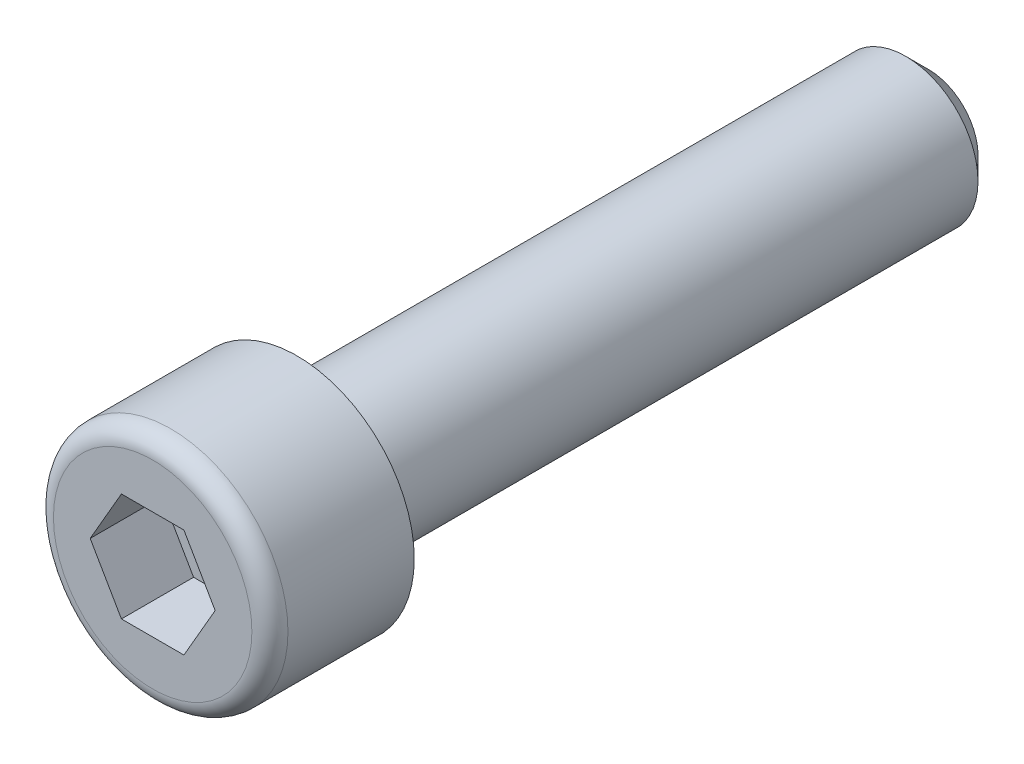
ISO-10303-21;
HEADER;
FILE_DESCRIPTION(('STEP AP214'),'2;1');
FILE_NAME('part.step','',(''),(''),'','','');
FILE_SCHEMA(('AUTOMOTIVE_DESIGN { 1 0 10303 214 1 1 1 1 }'));
ENDSEC;
DATA;
#1=APPLICATION_CONTEXT('core data for automotive mechanical design processes');
#2=APPLICATION_PROTOCOL_DEFINITION('international standard','automotive_design',2000,#1);
#3=PRODUCT_CONTEXT('',#1,'mechanical');
#4=PRODUCT('Part','Part','',(#3));
#5=PRODUCT_RELATED_PRODUCT_CATEGORY('part','',(#4));
#6=PRODUCT_DEFINITION_FORMATION('','',#4);
#7=PRODUCT_DEFINITION_CONTEXT('part definition',#1,'design');
#8=PRODUCT_DEFINITION('design','',#6,#7);
#9=PRODUCT_DEFINITION_SHAPE('','',#8);
#10=(LENGTH_UNIT() NAMED_UNIT(*) SI_UNIT(.MILLI.,.METRE.));
#11=(NAMED_UNIT(*) PLANE_ANGLE_UNIT() SI_UNIT($,.RADIAN.));
#12=(NAMED_UNIT(*) SI_UNIT($,.STERADIAN.) SOLID_ANGLE_UNIT());
#13=UNCERTAINTY_MEASURE_WITH_UNIT(LENGTH_MEASURE(1.E-05),#10,'distance_accuracy_value','');
#14=(GEOMETRIC_REPRESENTATION_CONTEXT(3) GLOBAL_UNCERTAINTY_ASSIGNED_CONTEXT((#13)) GLOBAL_UNIT_ASSIGNED_CONTEXT((#10,
#11,#12)) REPRESENTATION_CONTEXT('',''));
#15=CARTESIAN_POINT('',(0.,0.,0.));
#16=DIRECTION('',(0.,0.,1.));
#17=DIRECTION('',(1.,0.,0.));
#18=AXIS2_PLACEMENT_3D('',#15,#16,#17);
#19=CARTESIAN_POINT('',(0.,0.,0.));
#20=DIRECTION('',(0.,0.,1.));
#21=DIRECTION('',(1.,0.,0.));
#22=AXIS2_PLACEMENT_3D('',#19,#20,#21);
#23=PLANE('',#22);
#24=CARTESIAN_POINT('',(0.,0.,0.));
#25=DIRECTION('',(0.,0.,1.));
#26=DIRECTION('',(1.,0.,0.));
#27=AXIS2_PLACEMENT_3D('',#24,#25,#26);
#28=CIRCLE('',#27,6.5);
#29=CARTESIAN_POINT('',(6.5,0.,0.));
#30=VERTEX_POINT('',#29);
#31=EDGE_CURVE('E127',#30,#30,#28,.T.);
#32=ORIENTED_EDGE('',*,*,#31,.F.);
#33=EDGE_LOOP('',(#32));
#34=FACE_BOUND('',#33,.T.);
#35=CARTESIAN_POINT('',(0.,0.,0.));
#36=DIRECTION('',(0.,0.,1.));
#37=DIRECTION('',(1.,0.,0.));
#38=AXIS2_PLACEMENT_3D('',#35,#36,#37);
#39=CIRCLE('',#38,4.);
#40=CARTESIAN_POINT('',(4.,0.,0.));
#41=VERTEX_POINT('',#40);
#42=EDGE_CURVE('E142',#41,#41,#39,.F.);
#43=ORIENTED_EDGE('',*,*,#42,.F.);
#44=EDGE_LOOP('',(#43));
#45=FACE_BOUND('',#44,.T.);
#46=ADVANCED_FACE('F24',(#34,#45),#23,.F.);
#47=CARTESIAN_POINT('',(0.,0.,8.));
#48=DIRECTION('',(0.,0.,-1.));
#49=DIRECTION('',(-1.,0.,0.));
#50=AXIS2_PLACEMENT_3D('',#47,#48,#49);
#51=CYLINDRICAL_SURFACE('',#50,6.5);
#52=CARTESIAN_POINT('',(0.,0.,7.));
#53=DIRECTION('',(0.,0.,1.));
#54=DIRECTION('',(1.,0.,0.));
#55=AXIS2_PLACEMENT_3D('',#52,#53,#54);
#56=CIRCLE('',#55,6.5);
#57=CARTESIAN_POINT('',(6.5,0.,7.));
#58=VERTEX_POINT('',#57);
#59=EDGE_CURVE('E139',#58,#58,#56,.F.);
#60=ORIENTED_EDGE('',*,*,#59,.T.);
#61=EDGE_LOOP('',(#60));
#62=FACE_BOUND('',#61,.T.);
#63=ORIENTED_EDGE('',*,*,#31,.T.);
#64=EDGE_LOOP('',(#63));
#65=FACE_BOUND('',#64,.T.);
#66=ADVANCED_FACE('F26',(#62,#65),#51,.T.);
#67=CARTESIAN_POINT('',(0.,0.,8.));
#68=DIRECTION('',(0.,0.,1.));
#69=DIRECTION('',(1.,0.,0.));
#70=AXIS2_PLACEMENT_3D('',#67,#68,#69);
#71=PLANE('',#70);
#72=DIRECTION('',(0.5,0.866025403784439,0.));
#73=VECTOR('',#72,1.);
#74=CARTESIAN_POINT('',(1.73205080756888,-3.,8.));
#75=LINE('',#74,#73);
#76=CARTESIAN_POINT('',(1.73205080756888,-3.,8.));
#77=VERTEX_POINT('',#76);
#78=CARTESIAN_POINT('',(3.46410161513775,0.,8.));
#79=VERTEX_POINT('',#78);
#80=EDGE_CURVE('E39',#77,#79,#75,.T.);
#81=ORIENTED_EDGE('',*,*,#80,.F.);
#82=DIRECTION('',(1.,0.,0.));
#83=VECTOR('',#82,1.);
#84=CARTESIAN_POINT('',(-1.73205080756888,-3.,8.));
#85=LINE('',#84,#83);
#86=CARTESIAN_POINT('',(-1.73205080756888,-3.,8.));
#87=VERTEX_POINT('',#86);
#88=EDGE_CURVE('E109',#87,#77,#85,.T.);
#89=ORIENTED_EDGE('',*,*,#88,.F.);
#90=DIRECTION('',(0.5,-0.866025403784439,0.));
#91=VECTOR('',#90,1.);
#92=CARTESIAN_POINT('',(-3.46410161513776,0.,8.));
#93=LINE('',#92,#91);
#94=CARTESIAN_POINT('',(-3.46410161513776,0.,8.));
#95=VERTEX_POINT('',#94);
#96=EDGE_CURVE('E103',#95,#87,#93,.T.);
#97=ORIENTED_EDGE('',*,*,#96,.F.);
#98=DIRECTION('',(-0.5,-0.866025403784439,0.));
#99=VECTOR('',#98,1.);
#100=CARTESIAN_POINT('',(-1.73205080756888,3.,8.));
#101=LINE('',#100,#99);
#102=CARTESIAN_POINT('',(-1.73205080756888,3.,8.));
#103=VERTEX_POINT('',#102);
#104=EDGE_CURVE('E101',#103,#95,#101,.T.);
#105=ORIENTED_EDGE('',*,*,#104,.F.);
#106=DIRECTION('',(-1.,0.,0.));
#107=VECTOR('',#106,1.);
#108=CARTESIAN_POINT('',(1.73205080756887,3.,8.));
#109=LINE('',#108,#107);
#110=CARTESIAN_POINT('',(1.73205080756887,3.,8.));
#111=VERTEX_POINT('',#110);
#112=EDGE_CURVE('E82',#111,#103,#109,.T.);
#113=ORIENTED_EDGE('',*,*,#112,.F.);
#114=DIRECTION('',(-0.5,0.866025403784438,0.));
#115=VECTOR('',#114,1.);
#116=CARTESIAN_POINT('',(3.46410161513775,0.,8.));
#117=LINE('',#116,#115);
#118=EDGE_CURVE('E93',#79,#111,#117,.T.);
#119=ORIENTED_EDGE('',*,*,#118,.F.);
#120=EDGE_LOOP('',(#81,#89,#97,#105,#113,#119));
#121=FACE_BOUND('',#120,.T.);
#122=CARTESIAN_POINT('',(0.,0.,8.));
#123=DIRECTION('',(0.,0.,1.));
#124=DIRECTION('',(1.,0.,0.));
#125=AXIS2_PLACEMENT_3D('',#122,#123,#124);
#126=CIRCLE('',#125,5.5);
#127=CARTESIAN_POINT('',(5.5,0.,8.));
#128=VERTEX_POINT('',#127);
#129=EDGE_CURVE('E136',#128,#128,#126,.T.);
#130=ORIENTED_EDGE('',*,*,#129,.T.);
#131=EDGE_LOOP('',(#130));
#132=FACE_BOUND('',#131,.T.);
#133=ADVANCED_FACE('F97',(#121,#132),#71,.T.);
#134=CARTESIAN_POINT('',(0.,0.,7.));
#135=DIRECTION('',(0.,0.,1.));
#136=DIRECTION('',(1.,0.,0.));
#137=AXIS2_PLACEMENT_3D('',#134,#135,#136);
#138=TOROIDAL_SURFACE('',#137,5.5,1.);
#139=ORIENTED_EDGE('',*,*,#59,.F.);
#140=EDGE_LOOP('',(#139));
#141=FACE_BOUND('',#140,.T.);
#142=ORIENTED_EDGE('',*,*,#129,.F.);
#143=EDGE_LOOP('',(#142));
#144=FACE_BOUND('',#143,.T.);
#145=ADVANCED_FACE('F176',(#141,#144),#138,.T.);
#146=CARTESIAN_POINT('',(0.,0.,-35.));
#147=DIRECTION('',(0.,0.,1.));
#148=DIRECTION('',(1.,0.,0.));
#149=AXIS2_PLACEMENT_3D('',#146,#147,#148);
#150=CYLINDRICAL_SURFACE('',#149,4.);
#151=CARTESIAN_POINT('',(0.,0.,-33.75));
#152=DIRECTION('',(0.,0.,-1.));
#153=DIRECTION('',(-1.,0.,0.));
#154=AXIS2_PLACEMENT_3D('',#151,#152,#153);
#155=CIRCLE('',#154,4.);
#156=CARTESIAN_POINT('',(-4.,0.,-33.75));
#157=VERTEX_POINT('',#156);
#158=EDGE_CURVE('E11',#157,#157,#155,.F.);
#159=ORIENTED_EDGE('',*,*,#158,.T.);
#160=EDGE_LOOP('',(#159));
#161=FACE_BOUND('',#160,.T.);
#162=ORIENTED_EDGE('',*,*,#42,.T.);
#163=EDGE_LOOP('',(#162));
#164=FACE_BOUND('',#163,.T.);
#165=ADVANCED_FACE('F161',(#161,#164),#150,.T.);
#166=CARTESIAN_POINT('',(0.,0.,-35.));
#167=DIRECTION('',(0.,0.,-1.));
#168=DIRECTION('',(-1.,0.,0.));
#169=AXIS2_PLACEMENT_3D('',#166,#167,#168);
#170=PLANE('',#169);
#171=CARTESIAN_POINT('',(0.,0.,-35.));
#172=DIRECTION('',(0.,0.,-1.));
#173=DIRECTION('',(-1.,0.,0.));
#174=AXIS2_PLACEMENT_3D('',#171,#172,#173);
#175=CIRCLE('',#174,2.75);
#176=CARTESIAN_POINT('',(-2.75,0.,-35.));
#177=VERTEX_POINT('',#176);
#178=EDGE_CURVE('E32',#177,#177,#175,.T.);
#179=ORIENTED_EDGE('',*,*,#178,.T.);
#180=EDGE_LOOP('',(#179));
#181=FACE_BOUND('',#180,.T.);
#182=ADVANCED_FACE('F147',(#181),#170,.T.);
#183=CARTESIAN_POINT('',(0.,0.,-35.));
#184=DIRECTION('',(0.,0.,1.));
#185=DIRECTION('',(1.,0.,0.));
#186=AXIS2_PLACEMENT_3D('',#183,#184,#185);
#187=CONICAL_SURFACE('',#186,2.75,0.785398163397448);
#188=ORIENTED_EDGE('',*,*,#158,.F.);
#189=EDGE_LOOP('',(#188));
#190=FACE_BOUND('',#189,.T.);
#191=ORIENTED_EDGE('',*,*,#178,.F.);
#192=EDGE_LOOP('',(#191));
#193=FACE_BOUND('',#192,.T.);
#194=ADVANCED_FACE('F149',(#190,#193),#187,.T.);
#195=CARTESIAN_POINT('',(1.73205080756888,-3.,4.));
#196=DIRECTION('',(0.866025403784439,-0.5,0.));
#197=DIRECTION('',(0.5,0.866025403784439,0.));
#198=AXIS2_PLACEMENT_3D('',#195,#196,#197);
#199=PLANE('',#198);
#200=ORIENTED_EDGE('',*,*,#80,.T.);
#201=DIRECTION('',(0.,0.,1.));
#202=VECTOR('',#201,1.);
#203=CARTESIAN_POINT('',(3.46410161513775,0.,4.));
#204=LINE('',#203,#202);
#205=CARTESIAN_POINT('',(3.46410161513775,0.,4.));
#206=VERTEX_POINT('',#205);
#207=EDGE_CURVE('E90',#206,#79,#204,.T.);
#208=ORIENTED_EDGE('',*,*,#207,.F.);
#209=DIRECTION('',(0.5,0.866025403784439,0.));
#210=VECTOR('',#209,1.);
#211=CARTESIAN_POINT('',(1.73205080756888,-3.,4.));
#212=LINE('',#211,#210);
#213=CARTESIAN_POINT('',(1.73205080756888,-3.,4.));
#214=VERTEX_POINT('',#213);
#215=EDGE_CURVE('E111',#214,#206,#212,.T.);
#216=ORIENTED_EDGE('',*,*,#215,.F.);
#217=DIRECTION('',(0.,0.,1.));
#218=VECTOR('',#217,1.);
#219=CARTESIAN_POINT('',(1.73205080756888,-3.,4.));
#220=LINE('',#219,#218);
#221=EDGE_CURVE('E46',#214,#77,#220,.T.);
#222=ORIENTED_EDGE('',*,*,#221,.T.);
#223=EDGE_LOOP('',(#200,#208,#216,#222));
#224=FACE_BOUND('',#223,.T.);
#225=ADVANCED_FACE('F151',(#224),#199,.F.);
#226=CARTESIAN_POINT('',(-1.73205080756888,-3.,4.));
#227=DIRECTION('',(0.,-1.,0.));
#228=DIRECTION('',(1.,0.,0.));
#229=AXIS2_PLACEMENT_3D('',#226,#227,#228);
#230=PLANE('',#229);
#231=ORIENTED_EDGE('',*,*,#88,.T.);
#232=ORIENTED_EDGE('',*,*,#221,.F.);
#233=DIRECTION('',(1.,0.,0.));
#234=VECTOR('',#233,1.);
#235=CARTESIAN_POINT('',(-1.73205080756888,-3.,4.));
#236=LINE('',#235,#234);
#237=CARTESIAN_POINT('',(-1.73205080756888,-3.,4.));
#238=VERTEX_POINT('',#237);
#239=EDGE_CURVE('E123',#238,#214,#236,.T.);
#240=ORIENTED_EDGE('',*,*,#239,.F.);
#241=DIRECTION('',(0.,0.,1.));
#242=VECTOR('',#241,1.);
#243=CARTESIAN_POINT('',(-1.73205080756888,-3.,4.));
#244=LINE('',#243,#242);
#245=EDGE_CURVE('E128',#238,#87,#244,.T.);
#246=ORIENTED_EDGE('',*,*,#245,.T.);
#247=EDGE_LOOP('',(#231,#232,#240,#246));
#248=FACE_BOUND('',#247,.T.);
#249=ADVANCED_FACE('F159',(#248),#230,.F.);
#250=CARTESIAN_POINT('',(-3.46410161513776,0.,4.));
#251=DIRECTION('',(-0.866025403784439,-0.5,0.));
#252=DIRECTION('',(0.5,-0.866025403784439,0.));
#253=AXIS2_PLACEMENT_3D('',#250,#251,#252);
#254=PLANE('',#253);
#255=ORIENTED_EDGE('',*,*,#96,.T.);
#256=ORIENTED_EDGE('',*,*,#245,.F.);
#257=DIRECTION('',(0.5,-0.866025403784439,0.));
#258=VECTOR('',#257,1.);
#259=CARTESIAN_POINT('',(-3.46410161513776,0.,4.));
#260=LINE('',#259,#258);
#261=CARTESIAN_POINT('',(-3.46410161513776,0.,4.));
#262=VERTEX_POINT('',#261);
#263=EDGE_CURVE('E120',#262,#238,#260,.T.);
#264=ORIENTED_EDGE('',*,*,#263,.F.);
#265=DIRECTION('',(0.,0.,1.));
#266=VECTOR('',#265,1.);
#267=CARTESIAN_POINT('',(-3.46410161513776,0.,4.));
#268=LINE('',#267,#266);
#269=EDGE_CURVE('E130',#262,#95,#268,.T.);
#270=ORIENTED_EDGE('',*,*,#269,.T.);
#271=EDGE_LOOP('',(#255,#256,#264,#270));
#272=FACE_BOUND('',#271,.T.);
#273=ADVANCED_FACE('F209',(#272),#254,.F.);
#274=CARTESIAN_POINT('',(-1.73205080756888,3.,4.));
#275=DIRECTION('',(-0.866025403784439,0.5,0.));
#276=DIRECTION('',(-0.5,-0.866025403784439,0.));
#277=AXIS2_PLACEMENT_3D('',#274,#275,#276);
#278=PLANE('',#277);
#279=ORIENTED_EDGE('',*,*,#104,.T.);
#280=ORIENTED_EDGE('',*,*,#269,.F.);
#281=DIRECTION('',(-0.5,-0.866025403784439,0.));
#282=VECTOR('',#281,1.);
#283=CARTESIAN_POINT('',(-1.73205080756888,3.,4.));
#284=LINE('',#283,#282);
#285=CARTESIAN_POINT('',(-1.73205080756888,3.,4.));
#286=VERTEX_POINT('',#285);
#287=EDGE_CURVE('E117',#286,#262,#284,.T.);
#288=ORIENTED_EDGE('',*,*,#287,.F.);
#289=DIRECTION('',(0.,0.,1.));
#290=VECTOR('',#289,1.);
#291=CARTESIAN_POINT('',(-1.73205080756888,3.,4.));
#292=LINE('',#291,#290);
#293=EDGE_CURVE('E89',#286,#103,#292,.T.);
#294=ORIENTED_EDGE('',*,*,#293,.T.);
#295=EDGE_LOOP('',(#279,#280,#288,#294));
#296=FACE_BOUND('',#295,.T.);
#297=ADVANCED_FACE('F216',(#296),#278,.F.);
#298=CARTESIAN_POINT('',(1.73205080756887,3.,4.));
#299=DIRECTION('',(0.,1.,0.));
#300=DIRECTION('',(0.,0.,1.));
#301=AXIS2_PLACEMENT_3D('',#298,#299,#300);
#302=PLANE('',#301);
#303=ORIENTED_EDGE('',*,*,#112,.T.);
#304=ORIENTED_EDGE('',*,*,#293,.F.);
#305=DIRECTION('',(-1.,0.,0.));
#306=VECTOR('',#305,1.);
#307=CARTESIAN_POINT('',(1.73205080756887,3.,4.));
#308=LINE('',#307,#306);
#309=CARTESIAN_POINT('',(1.73205080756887,3.,4.));
#310=VERTEX_POINT('',#309);
#311=EDGE_CURVE('E85',#310,#286,#308,.T.);
#312=ORIENTED_EDGE('',*,*,#311,.F.);
#313=DIRECTION('',(0.,0.,1.));
#314=VECTOR('',#313,1.);
#315=CARTESIAN_POINT('',(1.73205080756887,3.,4.));
#316=LINE('',#315,#314);
#317=EDGE_CURVE('E78',#310,#111,#316,.T.);
#318=ORIENTED_EDGE('',*,*,#317,.T.);
#319=EDGE_LOOP('',(#303,#304,#312,#318));
#320=FACE_BOUND('',#319,.T.);
#321=ADVANCED_FACE('F80',(#320),#302,.F.);
#322=CARTESIAN_POINT('',(3.46410161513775,0.,4.));
#323=DIRECTION('',(0.866025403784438,0.500000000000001,0.));
#324=DIRECTION('',(-0.500000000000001,0.866025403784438,0.));
#325=AXIS2_PLACEMENT_3D('',#322,#323,#324);
#326=PLANE('',#325);
#327=ORIENTED_EDGE('',*,*,#118,.T.);
#328=ORIENTED_EDGE('',*,*,#317,.F.);
#329=DIRECTION('',(-0.5,0.866025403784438,0.));
#330=VECTOR('',#329,1.);
#331=CARTESIAN_POINT('',(3.46410161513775,0.,4.));
#332=LINE('',#331,#330);
#333=EDGE_CURVE('E114',#206,#310,#332,.T.);
#334=ORIENTED_EDGE('',*,*,#333,.F.);
#335=ORIENTED_EDGE('',*,*,#207,.T.);
#336=EDGE_LOOP('',(#327,#328,#334,#335));
#337=FACE_BOUND('',#336,.T.);
#338=ADVANCED_FACE('F94',(#337),#326,.F.);
#339=CARTESIAN_POINT('',(3.46410161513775,0.,4.));
#340=DIRECTION('',(0.,0.,1.));
#341=DIRECTION('',(1.,0.,0.));
#342=AXIS2_PLACEMENT_3D('',#339,#340,#341);
#343=PLANE('',#342);
#344=ORIENTED_EDGE('',*,*,#215,.T.);
#345=ORIENTED_EDGE('',*,*,#333,.T.);
#346=ORIENTED_EDGE('',*,*,#311,.T.);
#347=ORIENTED_EDGE('',*,*,#287,.T.);
#348=ORIENTED_EDGE('',*,*,#263,.T.);
#349=ORIENTED_EDGE('',*,*,#239,.T.);
#350=EDGE_LOOP('',(#344,#345,#346,#347,#348,#349));
#351=FACE_BOUND('',#350,.T.);
#352=ADVANCED_FACE('F237',(#351),#343,.T.);
#353=CLOSED_SHELL('',(#46,#66,#133,#145,#165,#182,#194,#225,#249,#273,#297,#321,#338,#352));
#354=MANIFOLD_SOLID_BREP('B2',#353);
#355=ADVANCED_BREP_SHAPE_REPRESENTATION('',(#18,#354),#14);
#356=SHAPE_DEFINITION_REPRESENTATION(#9,#355);
ENDSEC;
END-ISO-10303-21;
